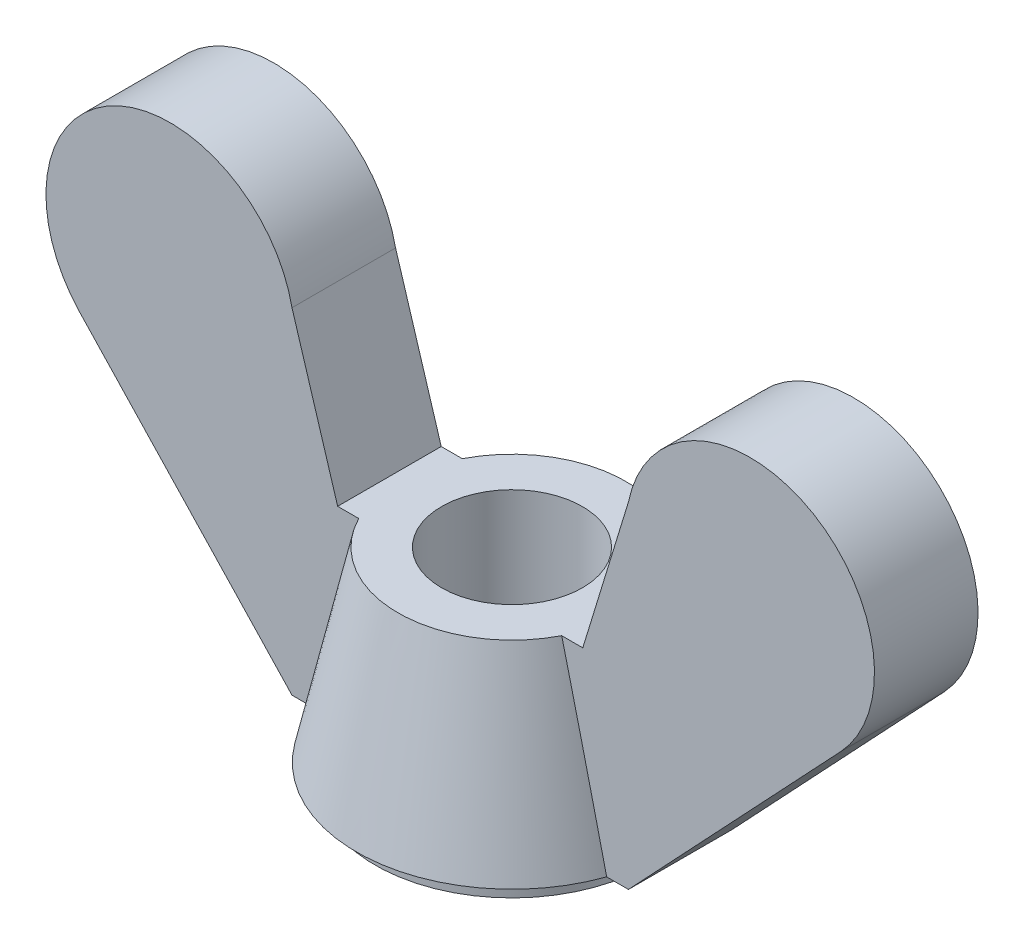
from build123d import *

# Parameters (mm, degrees)
TROU_TARAUD_M81_D  = 6.8
BOSS_EXTRU_1_DEPTH = 2.5


with BuildPart() as part:
    # Esquisse1 → R_volution1 (revolve)
    with BuildSketch(Plane.XY, mode=Mode.PRIVATE) as r_volution1_sk:
        Polygon((0, 0), (0, 10), (5.5, 10), (7.5, 1), (6.6, 1), (6.6, 0), align=None)
    revolve(r_volution1_sk.sketch.rotate(Axis((0, 0, 0), (0, 1, 0)), 90), axis=Axis((0, 0, 0), (0, 1, 0)))

    # Trou taraud_ M81 (through all)
    with Locations(Plane(origin=(0, 10, 0), x_dir=(1, 0, 0), z_dir=(0, 1, 0))):
        with Locations((0, 0)):
            Hole(TROU_TARAUD_M81_D / 2)

    # Esquisse4 → Boss.-Extru.1 (add, symmetric)
    with BuildSketch(Plane.XY):
        with BuildLine():
            Line((-5.510836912, 1), (-4.849536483, 10))
            Line((-4.849536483, 10), (-5.917060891, 10))
            Line((-5.917060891, 10), (-8.121316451, 17.200449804))
            ThreePointArc((-8.121316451, 17.200449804), (-16.761529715, 21.32672072), (-18.369093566, 11.887698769))
            Line((-18.369093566, 11.887698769), (-8.121316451, 1))
            Line((-8.121316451, 1), (-5.510836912, 1))
        make_face()
    boss_extru_1 = extrude(amount=BOSS_EXTRU_1_DEPTH, both=True)

    # Sym_trie1: Boss.-Extru.1 across plane
    add(boss_extru_1.mirror(Plane(origin=(0, 0, 0), x_dir=(0, 0, 1), z_dir=(1, 0, 0))))


solid = part.part
